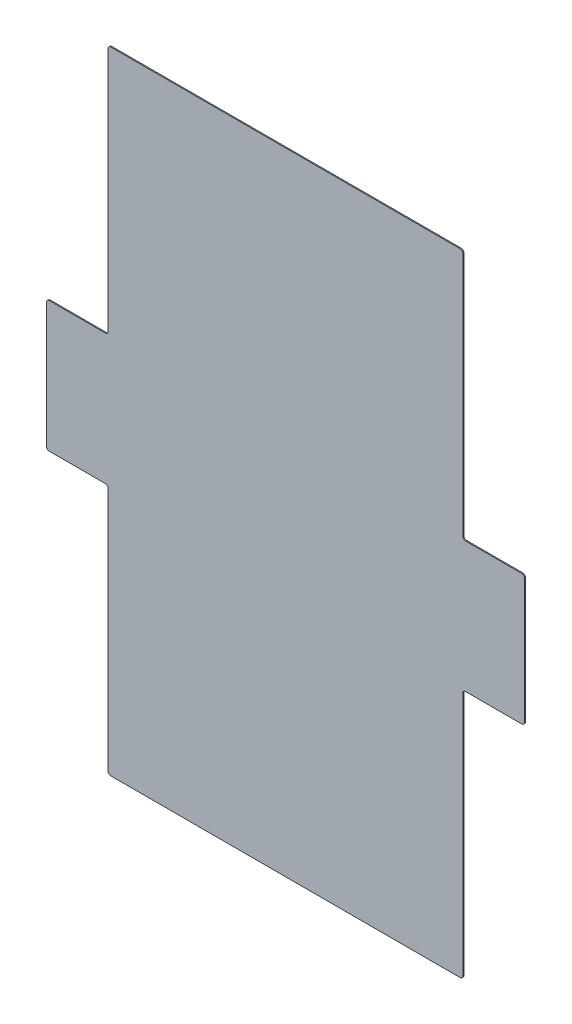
ISO-10303-21;
HEADER;
FILE_DESCRIPTION(('STEP AP214'),'2;1');
FILE_NAME('part.step','',(''),(''),'','','');
FILE_SCHEMA(('AUTOMOTIVE_DESIGN { 1 0 10303 214 1 1 1 1 }'));
ENDSEC;
DATA;
#1=APPLICATION_CONTEXT('core data for automotive mechanical design processes');
#2=APPLICATION_PROTOCOL_DEFINITION('international standard','automotive_design',2000,#1);
#3=PRODUCT_CONTEXT('',#1,'mechanical');
#4=PRODUCT('Part','Part','',(#3));
#5=PRODUCT_RELATED_PRODUCT_CATEGORY('part','',(#4));
#6=PRODUCT_DEFINITION_FORMATION('','',#4);
#7=PRODUCT_DEFINITION_CONTEXT('part definition',#1,'design');
#8=PRODUCT_DEFINITION('design','',#6,#7);
#9=PRODUCT_DEFINITION_SHAPE('','',#8);
#10=(LENGTH_UNIT() NAMED_UNIT(*) SI_UNIT(.MILLI.,.METRE.));
#11=(NAMED_UNIT(*) PLANE_ANGLE_UNIT() SI_UNIT($,.RADIAN.));
#12=(NAMED_UNIT(*) SI_UNIT($,.STERADIAN.) SOLID_ANGLE_UNIT());
#13=UNCERTAINTY_MEASURE_WITH_UNIT(LENGTH_MEASURE(1.E-05),#10,'distance_accuracy_value','');
#14=(GEOMETRIC_REPRESENTATION_CONTEXT(3) GLOBAL_UNCERTAINTY_ASSIGNED_CONTEXT((#13)) GLOBAL_UNIT_ASSIGNED_CONTEXT((#10,
#11,#12)) REPRESENTATION_CONTEXT('',''));
#15=CARTESIAN_POINT('',(0.,0.,0.));
#16=DIRECTION('',(0.,0.,1.));
#17=DIRECTION('',(1.,0.,0.));
#18=AXIS2_PLACEMENT_3D('',#15,#16,#17);
#19=CARTESIAN_POINT('',(-453.,120.,2.00000000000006));
#20=DIRECTION('',(0.,0.,-1.));
#21=DIRECTION('',(-1.,0.,0.));
#22=AXIS2_PLACEMENT_3D('',#19,#20,#21);
#23=CYLINDRICAL_SURFACE('',#22,5.);
#24=CARTESIAN_POINT('',(-453.,120.,0.));
#25=DIRECTION('',(0.,0.,-1.));
#26=DIRECTION('',(-1.,0.,0.));
#27=AXIS2_PLACEMENT_3D('',#24,#25,#26);
#28=CIRCLE('',#27,5.);
#29=CARTESIAN_POINT('',(-458.,120.,0.));
#30=VERTEX_POINT('',#29);
#31=CARTESIAN_POINT('',(-453.,125.,0.));
#32=VERTEX_POINT('',#31);
#33=EDGE_CURVE('E189',#30,#32,#28,.T.);
#34=ORIENTED_EDGE('',*,*,#33,.F.);
#35=DIRECTION('',(0.,0.,-1.));
#36=VECTOR('',#35,1.);
#37=CARTESIAN_POINT('',(-458.,120.,2.00000000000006));
#38=LINE('',#37,#36);
#39=CARTESIAN_POINT('',(-458.,120.,2.00000000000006));
#40=VERTEX_POINT('',#39);
#41=EDGE_CURVE('E11',#40,#30,#38,.T.);
#42=ORIENTED_EDGE('',*,*,#41,.F.);
#43=CARTESIAN_POINT('',(-453.,120.,2.00000000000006));
#44=DIRECTION('',(0.,0.,-1.));
#45=DIRECTION('',(-1.,0.,0.));
#46=AXIS2_PLACEMENT_3D('',#43,#44,#45);
#47=CIRCLE('',#46,5.);
#48=CARTESIAN_POINT('',(-453.,125.,2.00000000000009));
#49=VERTEX_POINT('',#48);
#50=EDGE_CURVE('E190',#40,#49,#47,.T.);
#51=ORIENTED_EDGE('',*,*,#50,.T.);
#52=DIRECTION('',(0.,0.,-1.));
#53=VECTOR('',#52,1.);
#54=CARTESIAN_POINT('',(-453.,125.,2.00000000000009));
#55=LINE('',#54,#53);
#56=EDGE_CURVE('E31',#49,#32,#55,.T.);
#57=ORIENTED_EDGE('',*,*,#56,.T.);
#58=EDGE_LOOP('',(#34,#42,#51,#57));
#59=FACE_BOUND('',#58,.T.);
#60=ADVANCED_FACE('F28',(#59),#23,.T.);
#61=CARTESIAN_POINT('',(-458.,120.,2.00000000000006));
#62=DIRECTION('',(1.,0.,0.));
#63=DIRECTION('',(0.,0.,-1.));
#64=AXIS2_PLACEMENT_3D('',#61,#62,#63);
#65=PLANE('',#64);
#66=DIRECTION('',(0.,-1.,0.));
#67=VECTOR('',#66,1.);
#68=CARTESIAN_POINT('',(-458.,120.,0.));
#69=LINE('',#68,#67);
#70=CARTESIAN_POINT('',(-458.,-120.,0.));
#71=VERTEX_POINT('',#70);
#72=EDGE_CURVE('E207',#30,#71,#69,.T.);
#73=ORIENTED_EDGE('',*,*,#72,.T.);
#74=DIRECTION('',(0.,0.,-1.));
#75=VECTOR('',#74,1.);
#76=CARTESIAN_POINT('',(-458.,-120.,2.00000000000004));
#77=LINE('',#76,#75);
#78=CARTESIAN_POINT('',(-458.,-120.,2.00000000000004));
#79=VERTEX_POINT('',#78);
#80=EDGE_CURVE('E36',#79,#71,#77,.T.);
#81=ORIENTED_EDGE('',*,*,#80,.F.);
#82=DIRECTION('',(0.,-1.,0.));
#83=VECTOR('',#82,1.);
#84=CARTESIAN_POINT('',(-458.,120.,2.00000000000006));
#85=LINE('',#84,#83);
#86=EDGE_CURVE('E49',#40,#79,#85,.T.);
#87=ORIENTED_EDGE('',*,*,#86,.F.);
#88=ORIENTED_EDGE('',*,*,#41,.T.);
#89=EDGE_LOOP('',(#73,#81,#87,#88));
#90=FACE_BOUND('',#89,.T.);
#91=ADVANCED_FACE('F461',(#90),#65,.F.);
#92=CARTESIAN_POINT('',(-453.,-120.,2.00000000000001));
#93=DIRECTION('',(0.,0.,-1.));
#94=DIRECTION('',(-1.,0.,0.));
#95=AXIS2_PLACEMENT_3D('',#92,#93,#94);
#96=CYLINDRICAL_SURFACE('',#95,5.);
#97=CARTESIAN_POINT('',(-453.,-120.,0.));
#98=DIRECTION('',(0.,0.,-1.));
#99=DIRECTION('',(-1.,0.,0.));
#100=AXIS2_PLACEMENT_3D('',#97,#98,#99);
#101=CIRCLE('',#100,5.);
#102=CARTESIAN_POINT('',(-453.,-125.,0.));
#103=VERTEX_POINT('',#102);
#104=EDGE_CURVE('E268',#103,#71,#101,.T.);
#105=ORIENTED_EDGE('',*,*,#104,.F.);
#106=DIRECTION('',(0.,0.,-1.));
#107=VECTOR('',#106,1.);
#108=CARTESIAN_POINT('',(-453.,-125.,2.00000000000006));
#109=LINE('',#108,#107);
#110=CARTESIAN_POINT('',(-453.,-125.,2.00000000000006));
#111=VERTEX_POINT('',#110);
#112=EDGE_CURVE('E334',#111,#103,#109,.T.);
#113=ORIENTED_EDGE('',*,*,#112,.F.);
#114=CARTESIAN_POINT('',(-453.,-120.,2.00000000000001));
#115=DIRECTION('',(0.,0.,-1.));
#116=DIRECTION('',(-1.,0.,0.));
#117=AXIS2_PLACEMENT_3D('',#114,#115,#116);
#118=CIRCLE('',#117,5.);
#119=EDGE_CURVE('E329',#111,#79,#118,.T.);
#120=ORIENTED_EDGE('',*,*,#119,.T.);
#121=ORIENTED_EDGE('',*,*,#80,.T.);
#122=EDGE_LOOP('',(#105,#113,#120,#121));
#123=FACE_BOUND('',#122,.T.);
#124=ADVANCED_FACE('F459',(#123),#96,.T.);
#125=CARTESIAN_POINT('',(-345.,-125.,2.00000000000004));
#126=DIRECTION('',(0.,-1.,0.));
#127=DIRECTION('',(1.,0.,0.));
#128=AXIS2_PLACEMENT_3D('',#125,#126,#127);
#129=PLANE('',#128);
#130=DIRECTION('',(-1.,0.,0.));
#131=VECTOR('',#130,1.);
#132=CARTESIAN_POINT('',(-345.,-125.,0.));
#133=LINE('',#132,#131);
#134=CARTESIAN_POINT('',(-345.,-125.,0.));
#135=VERTEX_POINT('',#134);
#136=EDGE_CURVE('E265',#135,#103,#133,.T.);
#137=ORIENTED_EDGE('',*,*,#136,.F.);
#138=DIRECTION('',(0.,0.,-1.));
#139=VECTOR('',#138,1.);
#140=CARTESIAN_POINT('',(-345.,-125.,2.00000000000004));
#141=LINE('',#140,#139);
#142=CARTESIAN_POINT('',(-345.,-125.,2.00000000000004));
#143=VERTEX_POINT('',#142);
#144=EDGE_CURVE('E336',#143,#135,#141,.T.);
#145=ORIENTED_EDGE('',*,*,#144,.F.);
#146=DIRECTION('',(-1.,0.,0.));
#147=VECTOR('',#146,1.);
#148=CARTESIAN_POINT('',(-345.,-125.,2.00000000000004));
#149=LINE('',#148,#147);
#150=EDGE_CURVE('E326',#143,#111,#149,.T.);
#151=ORIENTED_EDGE('',*,*,#150,.T.);
#152=ORIENTED_EDGE('',*,*,#112,.T.);
#153=EDGE_LOOP('',(#137,#145,#151,#152));
#154=FACE_BOUND('',#153,.T.);
#155=ADVANCED_FACE('F456',(#154),#129,.T.);
#156=CARTESIAN_POINT('',(-345.,-130.,2.00000000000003));
#157=DIRECTION('',(0.,0.,-1.));
#158=DIRECTION('',(-1.,0.,0.));
#159=AXIS2_PLACEMENT_3D('',#156,#157,#158);
#160=CYLINDRICAL_SURFACE('',#159,5.00000000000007);
#161=CARTESIAN_POINT('',(-345.,-130.,0.));
#162=DIRECTION('',(0.,0.,1.));
#163=DIRECTION('',(1.,0.,0.));
#164=AXIS2_PLACEMENT_3D('',#161,#162,#163);
#165=CIRCLE('',#164,5.00000000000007);
#166=CARTESIAN_POINT('',(-340.,-130.,0.));
#167=VERTEX_POINT('',#166);
#168=EDGE_CURVE('E262',#167,#135,#165,.T.);
#169=ORIENTED_EDGE('',*,*,#168,.F.);
#170=DIRECTION('',(0.,0.,-1.));
#171=VECTOR('',#170,1.);
#172=CARTESIAN_POINT('',(-340.,-130.,2.00000000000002));
#173=LINE('',#172,#171);
#174=CARTESIAN_POINT('',(-340.,-130.,2.00000000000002));
#175=VERTEX_POINT('',#174);
#176=EDGE_CURVE('E338',#175,#167,#173,.T.);
#177=ORIENTED_EDGE('',*,*,#176,.F.);
#178=CARTESIAN_POINT('',(-345.,-130.,2.00000000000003));
#179=DIRECTION('',(0.,0.,1.));
#180=DIRECTION('',(1.,0.,0.));
#181=AXIS2_PLACEMENT_3D('',#178,#179,#180);
#182=CIRCLE('',#181,5.00000000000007);
#183=EDGE_CURVE('E323',#175,#143,#182,.T.);
#184=ORIENTED_EDGE('',*,*,#183,.T.);
#185=ORIENTED_EDGE('',*,*,#144,.T.);
#186=EDGE_LOOP('',(#169,#177,#184,#185));
#187=FACE_BOUND('',#186,.T.);
#188=ADVANCED_FACE('F451',(#187),#160,.F.);
#189=CARTESIAN_POINT('',(-340.,-130.,2.00000000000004));
#190=DIRECTION('',(1.,0.,0.));
#191=DIRECTION('',(0.,0.,-1.));
#192=AXIS2_PLACEMENT_3D('',#189,#190,#191);
#193=PLANE('',#192);
#194=DIRECTION('',(0.,-1.,0.));
#195=VECTOR('',#194,1.);
#196=CARTESIAN_POINT('',(-340.,-130.,0.));
#197=LINE('',#196,#195);
#198=CARTESIAN_POINT('',(-340.,-600.,0.));
#199=VERTEX_POINT('',#198);
#200=EDGE_CURVE('E259',#167,#199,#197,.T.);
#201=ORIENTED_EDGE('',*,*,#200,.T.);
#202=DIRECTION('',(0.,0.,-1.));
#203=VECTOR('',#202,1.);
#204=CARTESIAN_POINT('',(-340.,-600.,1.99999999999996));
#205=LINE('',#204,#203);
#206=CARTESIAN_POINT('',(-340.,-600.,1.99999999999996));
#207=VERTEX_POINT('',#206);
#208=EDGE_CURVE('E340',#207,#199,#205,.T.);
#209=ORIENTED_EDGE('',*,*,#208,.F.);
#210=DIRECTION('',(0.,-1.,0.));
#211=VECTOR('',#210,1.);
#212=CARTESIAN_POINT('',(-340.,-130.,2.00000000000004));
#213=LINE('',#212,#211);
#214=EDGE_CURVE('E321',#175,#207,#213,.T.);
#215=ORIENTED_EDGE('',*,*,#214,.F.);
#216=ORIENTED_EDGE('',*,*,#176,.T.);
#217=EDGE_LOOP('',(#201,#209,#215,#216));
#218=FACE_BOUND('',#217,.T.);
#219=ADVANCED_FACE('F448',(#218),#193,.F.);
#220=CARTESIAN_POINT('',(-335.,-600.,1.99999999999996));
#221=DIRECTION('',(0.,0.,-1.));
#222=DIRECTION('',(-1.,0.,0.));
#223=AXIS2_PLACEMENT_3D('',#220,#221,#222);
#224=CYLINDRICAL_SURFACE('',#223,5.);
#225=CARTESIAN_POINT('',(-335.,-600.,0.));
#226=DIRECTION('',(0.,0.,-1.));
#227=DIRECTION('',(-1.,0.,0.));
#228=AXIS2_PLACEMENT_3D('',#225,#226,#227);
#229=CIRCLE('',#228,5.);
#230=CARTESIAN_POINT('',(-335.,-605.,0.));
#231=VERTEX_POINT('',#230);
#232=EDGE_CURVE('E256',#231,#199,#229,.T.);
#233=ORIENTED_EDGE('',*,*,#232,.F.);
#234=DIRECTION('',(0.,0.,-1.));
#235=VECTOR('',#234,1.);
#236=CARTESIAN_POINT('',(-335.,-605.,1.99999999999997));
#237=LINE('',#236,#235);
#238=CARTESIAN_POINT('',(-335.,-605.,1.99999999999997));
#239=VERTEX_POINT('',#238);
#240=EDGE_CURVE('E342',#239,#231,#237,.T.);
#241=ORIENTED_EDGE('',*,*,#240,.F.);
#242=CARTESIAN_POINT('',(-335.,-600.,1.99999999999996));
#243=DIRECTION('',(0.,0.,-1.));
#244=DIRECTION('',(-1.,0.,0.));
#245=AXIS2_PLACEMENT_3D('',#242,#243,#244);
#246=CIRCLE('',#245,5.);
#247=EDGE_CURVE('E318',#239,#207,#246,.T.);
#248=ORIENTED_EDGE('',*,*,#247,.T.);
#249=ORIENTED_EDGE('',*,*,#208,.T.);
#250=EDGE_LOOP('',(#233,#241,#248,#249));
#251=FACE_BOUND('',#250,.T.);
#252=ADVANCED_FACE('F444',(#251),#224,.T.);
#253=CARTESIAN_POINT('',(335.,-605.,2.));
#254=DIRECTION('',(0.,-1.,0.));
#255=DIRECTION('',(1.,0.,0.));
#256=AXIS2_PLACEMENT_3D('',#253,#254,#255);
#257=PLANE('',#256);
#258=DIRECTION('',(-1.,0.,0.));
#259=VECTOR('',#258,1.);
#260=CARTESIAN_POINT('',(335.,-605.,-1.11022302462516E-13));
#261=LINE('',#260,#259);
#262=CARTESIAN_POINT('',(335.,-605.,-1.11022302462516E-13));
#263=VERTEX_POINT('',#262);
#264=EDGE_CURVE('E253',#263,#231,#261,.T.);
#265=ORIENTED_EDGE('',*,*,#264,.F.);
#266=DIRECTION('',(0.,0.,-1.));
#267=VECTOR('',#266,1.);
#268=CARTESIAN_POINT('',(335.,-605.,2.));
#269=LINE('',#268,#267);
#270=CARTESIAN_POINT('',(335.,-605.,2.));
#271=VERTEX_POINT('',#270);
#272=EDGE_CURVE('E344',#271,#263,#269,.T.);
#273=ORIENTED_EDGE('',*,*,#272,.F.);
#274=DIRECTION('',(-1.,0.,0.));
#275=VECTOR('',#274,1.);
#276=CARTESIAN_POINT('',(335.,-605.,2.));
#277=LINE('',#276,#275);
#278=EDGE_CURVE('E315',#271,#239,#277,.T.);
#279=ORIENTED_EDGE('',*,*,#278,.T.);
#280=ORIENTED_EDGE('',*,*,#240,.T.);
#281=EDGE_LOOP('',(#265,#273,#279,#280));
#282=FACE_BOUND('',#281,.T.);
#283=ADVANCED_FACE('F440',(#282),#257,.T.);
#284=CARTESIAN_POINT('',(335.,-600.,1.99999999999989));
#285=DIRECTION('',(0.,0.,-1.));
#286=DIRECTION('',(-1.,0.,0.));
#287=AXIS2_PLACEMENT_3D('',#284,#285,#286);
#288=CYLINDRICAL_SURFACE('',#287,5.);
#289=CARTESIAN_POINT('',(335.,-600.,-1.66533453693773E-13));
#290=DIRECTION('',(0.,0.,-1.));
#291=DIRECTION('',(-1.,0.,0.));
#292=AXIS2_PLACEMENT_3D('',#289,#290,#291);
#293=CIRCLE('',#292,5.);
#294=CARTESIAN_POINT('',(340.,-600.,-1.66533453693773E-13));
#295=VERTEX_POINT('',#294);
#296=EDGE_CURVE('E250',#295,#263,#293,.T.);
#297=ORIENTED_EDGE('',*,*,#296,.F.);
#298=DIRECTION('',(0.,0.,-1.));
#299=VECTOR('',#298,1.);
#300=CARTESIAN_POINT('',(340.,-600.,1.99999999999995));
#301=LINE('',#300,#299);
#302=CARTESIAN_POINT('',(340.,-600.,1.99999999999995));
#303=VERTEX_POINT('',#302);
#304=EDGE_CURVE('E346',#303,#295,#301,.T.);
#305=ORIENTED_EDGE('',*,*,#304,.F.);
#306=CARTESIAN_POINT('',(335.,-600.,1.99999999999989));
#307=DIRECTION('',(0.,0.,-1.));
#308=DIRECTION('',(-1.,0.,0.));
#309=AXIS2_PLACEMENT_3D('',#306,#307,#308);
#310=CIRCLE('',#309,5.);
#311=EDGE_CURVE('E312',#303,#271,#310,.T.);
#312=ORIENTED_EDGE('',*,*,#311,.T.);
#313=ORIENTED_EDGE('',*,*,#272,.T.);
#314=EDGE_LOOP('',(#297,#305,#312,#313));
#315=FACE_BOUND('',#314,.T.);
#316=ADVANCED_FACE('F435',(#315),#288,.T.);
#317=CARTESIAN_POINT('',(340.,-600.,1.99999999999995));
#318=DIRECTION('',(-1.,0.,0.));
#319=DIRECTION('',(0.,-1.,0.));
#320=AXIS2_PLACEMENT_3D('',#317,#318,#319);
#321=PLANE('',#320);
#322=DIRECTION('',(0.,1.,0.));
#323=VECTOR('',#322,1.);
#324=CARTESIAN_POINT('',(340.,-600.,-1.66533453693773E-13));
#325=LINE('',#324,#323);
#326=CARTESIAN_POINT('',(340.,-130.,-1.38777878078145E-13));
#327=VERTEX_POINT('',#326);
#328=EDGE_CURVE('E247',#295,#327,#325,.T.);
#329=ORIENTED_EDGE('',*,*,#328,.T.);
#330=DIRECTION('',(0.,0.,-1.));
#331=VECTOR('',#330,1.);
#332=CARTESIAN_POINT('',(340.,-130.,1.99999999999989));
#333=LINE('',#332,#331);
#334=CARTESIAN_POINT('',(340.,-130.,1.99999999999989));
#335=VERTEX_POINT('',#334);
#336=EDGE_CURVE('E348',#335,#327,#333,.T.);
#337=ORIENTED_EDGE('',*,*,#336,.F.);
#338=DIRECTION('',(0.,1.,0.));
#339=VECTOR('',#338,1.);
#340=CARTESIAN_POINT('',(340.,-600.,1.99999999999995));
#341=LINE('',#340,#339);
#342=EDGE_CURVE('E310',#303,#335,#341,.T.);
#343=ORIENTED_EDGE('',*,*,#342,.F.);
#344=ORIENTED_EDGE('',*,*,#304,.T.);
#345=EDGE_LOOP('',(#329,#337,#343,#344));
#346=FACE_BOUND('',#345,.T.);
#347=ADVANCED_FACE('F432',(#346),#321,.F.);
#348=CARTESIAN_POINT('',(345.,-130.,1.99999999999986));
#349=DIRECTION('',(0.,0.,-1.));
#350=DIRECTION('',(-1.,0.,0.));
#351=AXIS2_PLACEMENT_3D('',#348,#349,#350);
#352=CYLINDRICAL_SURFACE('',#351,5.00000000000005);
#353=CARTESIAN_POINT('',(345.,-130.,-1.38777878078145E-13));
#354=DIRECTION('',(0.,0.,1.));
#355=DIRECTION('',(1.,0.,0.));
#356=AXIS2_PLACEMENT_3D('',#353,#354,#355);
#357=CIRCLE('',#356,5.00000000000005);
#358=CARTESIAN_POINT('',(345.,-125.,-1.11022302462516E-13));
#359=VERTEX_POINT('',#358);
#360=EDGE_CURVE('E244',#359,#327,#357,.T.);
#361=ORIENTED_EDGE('',*,*,#360,.F.);
#362=DIRECTION('',(0.,0.,-1.));
#363=VECTOR('',#362,1.);
#364=CARTESIAN_POINT('',(345.,-125.,1.99999999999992));
#365=LINE('',#364,#363);
#366=CARTESIAN_POINT('',(345.,-125.,1.99999999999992));
#367=VERTEX_POINT('',#366);
#368=EDGE_CURVE('E350',#367,#359,#365,.T.);
#369=ORIENTED_EDGE('',*,*,#368,.F.);
#370=CARTESIAN_POINT('',(345.,-130.,1.99999999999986));
#371=DIRECTION('',(0.,0.,1.));
#372=DIRECTION('',(1.,0.,0.));
#373=AXIS2_PLACEMENT_3D('',#370,#371,#372);
#374=CIRCLE('',#373,5.00000000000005);
#375=EDGE_CURVE('E307',#367,#335,#374,.T.);
#376=ORIENTED_EDGE('',*,*,#375,.T.);
#377=ORIENTED_EDGE('',*,*,#336,.T.);
#378=EDGE_LOOP('',(#361,#369,#376,#377));
#379=FACE_BOUND('',#378,.T.);
#380=ADVANCED_FACE('F427',(#379),#352,.F.);
#381=CARTESIAN_POINT('',(453.,-125.,1.99999999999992));
#382=DIRECTION('',(0.,-1.,0.));
#383=DIRECTION('',(1.,0.,0.));
#384=AXIS2_PLACEMENT_3D('',#381,#382,#383);
#385=PLANE('',#384);
#386=DIRECTION('',(-1.,0.,0.));
#387=VECTOR('',#386,1.);
#388=CARTESIAN_POINT('',(453.,-125.,0.));
#389=LINE('',#388,#387);
#390=CARTESIAN_POINT('',(453.,-125.,0.));
#391=VERTEX_POINT('',#390);
#392=EDGE_CURVE('E241',#391,#359,#389,.T.);
#393=ORIENTED_EDGE('',*,*,#392,.F.);
#394=DIRECTION('',(0.,0.,-1.));
#395=VECTOR('',#394,1.);
#396=CARTESIAN_POINT('',(453.,-125.,1.99999999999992));
#397=LINE('',#396,#395);
#398=CARTESIAN_POINT('',(453.,-125.,1.99999999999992));
#399=VERTEX_POINT('',#398);
#400=EDGE_CURVE('E352',#399,#391,#397,.T.);
#401=ORIENTED_EDGE('',*,*,#400,.F.);
#402=DIRECTION('',(-1.,0.,0.));
#403=VECTOR('',#402,1.);
#404=CARTESIAN_POINT('',(453.,-125.,1.99999999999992));
#405=LINE('',#404,#403);
#406=EDGE_CURVE('E304',#399,#367,#405,.T.);
#407=ORIENTED_EDGE('',*,*,#406,.T.);
#408=ORIENTED_EDGE('',*,*,#368,.T.);
#409=EDGE_LOOP('',(#393,#401,#407,#408));
#410=FACE_BOUND('',#409,.T.);
#411=ADVANCED_FACE('F422',(#410),#385,.T.);
#412=CARTESIAN_POINT('',(453.,-120.,1.99999999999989));
#413=DIRECTION('',(0.,0.,-1.));
#414=DIRECTION('',(-1.,0.,0.));
#415=AXIS2_PLACEMENT_3D('',#412,#413,#414);
#416=CYLINDRICAL_SURFACE('',#415,4.9999999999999);
#417=CARTESIAN_POINT('',(453.,-120.,-1.11022302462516E-13));
#418=DIRECTION('',(0.,0.,-1.));
#419=DIRECTION('',(-1.,0.,0.));
#420=AXIS2_PLACEMENT_3D('',#417,#418,#419);
#421=CIRCLE('',#420,4.9999999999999);
#422=CARTESIAN_POINT('',(458.,-120.,-1.11022302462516E-13));
#423=VERTEX_POINT('',#422);
#424=EDGE_CURVE('E238',#423,#391,#421,.T.);
#425=ORIENTED_EDGE('',*,*,#424,.F.);
#426=DIRECTION('',(0.,0.,-1.));
#427=VECTOR('',#426,1.);
#428=CARTESIAN_POINT('',(458.,-120.,1.99999999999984));
#429=LINE('',#428,#427);
#430=CARTESIAN_POINT('',(458.,-120.,1.99999999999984));
#431=VERTEX_POINT('',#430);
#432=EDGE_CURVE('E354',#431,#423,#429,.T.);
#433=ORIENTED_EDGE('',*,*,#432,.F.);
#434=CARTESIAN_POINT('',(453.,-120.,1.99999999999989));
#435=DIRECTION('',(0.,0.,-1.));
#436=DIRECTION('',(-1.,0.,0.));
#437=AXIS2_PLACEMENT_3D('',#434,#435,#436);
#438=CIRCLE('',#437,4.9999999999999);
#439=EDGE_CURVE('E301',#431,#399,#438,.T.);
#440=ORIENTED_EDGE('',*,*,#439,.T.);
#441=ORIENTED_EDGE('',*,*,#400,.T.);
#442=EDGE_LOOP('',(#425,#433,#440,#441));
#443=FACE_BOUND('',#442,.T.);
#444=ADVANCED_FACE('F417',(#443),#416,.T.);
#445=CARTESIAN_POINT('',(458.,-120.,1.99999999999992));
#446=DIRECTION('',(-1.,0.,0.));
#447=DIRECTION('',(0.,0.,1.));
#448=AXIS2_PLACEMENT_3D('',#445,#446,#447);
#449=PLANE('',#448);
#450=DIRECTION('',(0.,1.,0.));
#451=VECTOR('',#450,1.);
#452=CARTESIAN_POINT('',(458.,-120.,0.));
#453=LINE('',#452,#451);
#454=CARTESIAN_POINT('',(458.,120.,0.));
#455=VERTEX_POINT('',#454);
#456=EDGE_CURVE('E235',#423,#455,#453,.T.);
#457=ORIENTED_EDGE('',*,*,#456,.T.);
#458=DIRECTION('',(0.,0.,-1.));
#459=VECTOR('',#458,1.);
#460=CARTESIAN_POINT('',(458.,120.,1.99999999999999));
#461=LINE('',#460,#459);
#462=CARTESIAN_POINT('',(458.,120.,1.99999999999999));
#463=VERTEX_POINT('',#462);
#464=EDGE_CURVE('E356',#463,#455,#461,.T.);
#465=ORIENTED_EDGE('',*,*,#464,.F.);
#466=DIRECTION('',(0.,1.,0.));
#467=VECTOR('',#466,1.);
#468=CARTESIAN_POINT('',(458.,-120.,1.99999999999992));
#469=LINE('',#468,#467);
#470=EDGE_CURVE('E299',#431,#463,#469,.T.);
#471=ORIENTED_EDGE('',*,*,#470,.F.);
#472=ORIENTED_EDGE('',*,*,#432,.T.);
#473=EDGE_LOOP('',(#457,#465,#471,#472));
#474=FACE_BOUND('',#473,.T.);
#475=ADVANCED_FACE('F414',(#474),#449,.F.);
#476=CARTESIAN_POINT('',(453.,120.,2.));
#477=DIRECTION('',(0.,0.,-1.));
#478=DIRECTION('',(-1.,0.,0.));
#479=AXIS2_PLACEMENT_3D('',#476,#477,#478);
#480=CYLINDRICAL_SURFACE('',#479,4.9999999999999);
#481=CARTESIAN_POINT('',(453.,120.,0.));
#482=DIRECTION('',(0.,0.,-1.));
#483=DIRECTION('',(-1.,0.,0.));
#484=AXIS2_PLACEMENT_3D('',#481,#482,#483);
#485=CIRCLE('',#484,4.9999999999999);
#486=CARTESIAN_POINT('',(453.,125.,0.));
#487=VERTEX_POINT('',#486);
#488=EDGE_CURVE('E232',#487,#455,#485,.T.);
#489=ORIENTED_EDGE('',*,*,#488,.F.);
#490=DIRECTION('',(0.,0.,-1.));
#491=VECTOR('',#490,1.);
#492=CARTESIAN_POINT('',(453.,125.,1.9999999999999));
#493=LINE('',#492,#491);
#494=CARTESIAN_POINT('',(453.,125.,1.9999999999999));
#495=VERTEX_POINT('',#494);
#496=EDGE_CURVE('E358',#495,#487,#493,.T.);
#497=ORIENTED_EDGE('',*,*,#496,.F.);
#498=CARTESIAN_POINT('',(453.,120.,2.));
#499=DIRECTION('',(0.,0.,-1.));
#500=DIRECTION('',(-1.,0.,0.));
#501=AXIS2_PLACEMENT_3D('',#498,#499,#500);
#502=CIRCLE('',#501,4.9999999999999);
#503=EDGE_CURVE('E296',#495,#463,#502,.T.);
#504=ORIENTED_EDGE('',*,*,#503,.T.);
#505=ORIENTED_EDGE('',*,*,#464,.T.);
#506=EDGE_LOOP('',(#489,#497,#504,#505));
#507=FACE_BOUND('',#506,.T.);
#508=ADVANCED_FACE('F410',(#507),#480,.T.);
#509=CARTESIAN_POINT('',(345.,125.,1.99999999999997));
#510=DIRECTION('',(0.,1.,0.));
#511=DIRECTION('',(-1.,0.,0.));
#512=AXIS2_PLACEMENT_3D('',#509,#510,#511);
#513=PLANE('',#512);
#514=DIRECTION('',(1.,0.,0.));
#515=VECTOR('',#514,1.);
#516=CARTESIAN_POINT('',(345.,125.,0.));
#517=LINE('',#516,#515);
#518=CARTESIAN_POINT('',(345.,125.,0.));
#519=VERTEX_POINT('',#518);
#520=EDGE_CURVE('E229',#519,#487,#517,.T.);
#521=ORIENTED_EDGE('',*,*,#520,.F.);
#522=DIRECTION('',(0.,0.,-1.));
#523=VECTOR('',#522,1.);
#524=CARTESIAN_POINT('',(345.,125.,1.99999999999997));
#525=LINE('',#524,#523);
#526=CARTESIAN_POINT('',(345.,125.,1.99999999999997));
#527=VERTEX_POINT('',#526);
#528=EDGE_CURVE('E360',#527,#519,#525,.T.);
#529=ORIENTED_EDGE('',*,*,#528,.F.);
#530=DIRECTION('',(1.,0.,0.));
#531=VECTOR('',#530,1.);
#532=CARTESIAN_POINT('',(345.,125.,1.99999999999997));
#533=LINE('',#532,#531);
#534=EDGE_CURVE('E293',#527,#495,#533,.T.);
#535=ORIENTED_EDGE('',*,*,#534,.T.);
#536=ORIENTED_EDGE('',*,*,#496,.T.);
#537=EDGE_LOOP('',(#521,#529,#535,#536));
#538=FACE_BOUND('',#537,.T.);
#539=ADVANCED_FACE('F406',(#538),#513,.T.);
#540=CARTESIAN_POINT('',(345.,130.,2.));
#541=DIRECTION('',(0.,0.,-1.));
#542=DIRECTION('',(-1.,0.,0.));
#543=AXIS2_PLACEMENT_3D('',#540,#541,#542);
#544=CYLINDRICAL_SURFACE('',#543,5.00000000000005);
#545=CARTESIAN_POINT('',(345.,130.,0.));
#546=DIRECTION('',(0.,0.,1.));
#547=DIRECTION('',(1.,0.,0.));
#548=AXIS2_PLACEMENT_3D('',#545,#546,#547);
#549=CIRCLE('',#548,5.00000000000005);
#550=CARTESIAN_POINT('',(340.,130.,0.));
#551=VERTEX_POINT('',#550);
#552=EDGE_CURVE('E226',#551,#519,#549,.T.);
#553=ORIENTED_EDGE('',*,*,#552,.F.);
#554=DIRECTION('',(0.,0.,-1.));
#555=VECTOR('',#554,1.);
#556=CARTESIAN_POINT('',(340.,130.,1.99999999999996));
#557=LINE('',#556,#555);
#558=CARTESIAN_POINT('',(340.,130.,1.99999999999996));
#559=VERTEX_POINT('',#558);
#560=EDGE_CURVE('E362',#559,#551,#557,.T.);
#561=ORIENTED_EDGE('',*,*,#560,.F.);
#562=CARTESIAN_POINT('',(345.,130.,2.));
#563=DIRECTION('',(0.,0.,1.));
#564=DIRECTION('',(1.,0.,0.));
#565=AXIS2_PLACEMENT_3D('',#562,#563,#564);
#566=CIRCLE('',#565,5.00000000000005);
#567=EDGE_CURVE('E290',#559,#527,#566,.T.);
#568=ORIENTED_EDGE('',*,*,#567,.T.);
#569=ORIENTED_EDGE('',*,*,#528,.T.);
#570=EDGE_LOOP('',(#553,#561,#568,#569));
#571=FACE_BOUND('',#570,.T.);
#572=ADVANCED_FACE('F401',(#571),#544,.F.);
#573=CARTESIAN_POINT('',(340.,130.,1.99999999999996));
#574=DIRECTION('',(-1.,0.,0.));
#575=DIRECTION('',(0.,-1.,0.));
#576=AXIS2_PLACEMENT_3D('',#573,#574,#575);
#577=PLANE('',#576);
#578=DIRECTION('',(0.,1.,0.));
#579=VECTOR('',#578,1.);
#580=CARTESIAN_POINT('',(340.,130.,0.));
#581=LINE('',#580,#579);
#582=CARTESIAN_POINT('',(340.,600.,0.));
#583=VERTEX_POINT('',#582);
#584=EDGE_CURVE('E223',#551,#583,#581,.T.);
#585=ORIENTED_EDGE('',*,*,#584,.T.);
#586=DIRECTION('',(0.,0.,-1.));
#587=VECTOR('',#586,1.);
#588=CARTESIAN_POINT('',(340.,600.,2.00000000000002));
#589=LINE('',#588,#587);
#590=CARTESIAN_POINT('',(340.,600.,2.00000000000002));
#591=VERTEX_POINT('',#590);
#592=EDGE_CURVE('E364',#591,#583,#589,.T.);
#593=ORIENTED_EDGE('',*,*,#592,.F.);
#594=DIRECTION('',(0.,1.,0.));
#595=VECTOR('',#594,1.);
#596=CARTESIAN_POINT('',(340.,130.,1.99999999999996));
#597=LINE('',#596,#595);
#598=EDGE_CURVE('E288',#559,#591,#597,.T.);
#599=ORIENTED_EDGE('',*,*,#598,.F.);
#600=ORIENTED_EDGE('',*,*,#560,.T.);
#601=EDGE_LOOP('',(#585,#593,#599,#600));
#602=FACE_BOUND('',#601,.T.);
#603=ADVANCED_FACE('F398',(#602),#577,.F.);
#604=CARTESIAN_POINT('',(335.,600.000000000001,2.00000000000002));
#605=DIRECTION('',(0.,0.,-1.));
#606=DIRECTION('',(-1.,0.,0.));
#607=AXIS2_PLACEMENT_3D('',#604,#605,#606);
#608=CYLINDRICAL_SURFACE('',#607,5.00000000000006);
#609=CARTESIAN_POINT('',(335.,600.000000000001,0.));
#610=DIRECTION('',(0.,0.,-1.));
#611=DIRECTION('',(-1.,0.,0.));
#612=AXIS2_PLACEMENT_3D('',#609,#610,#611);
#613=CIRCLE('',#612,5.00000000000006);
#614=CARTESIAN_POINT('',(335.,605.000000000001,0.));
#615=VERTEX_POINT('',#614);
#616=EDGE_CURVE('E220',#615,#583,#613,.T.);
#617=ORIENTED_EDGE('',*,*,#616,.F.);
#618=DIRECTION('',(0.,0.,-1.));
#619=VECTOR('',#618,1.);
#620=CARTESIAN_POINT('',(335.,605.000000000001,2.00000000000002));
#621=LINE('',#620,#619);
#622=CARTESIAN_POINT('',(335.,605.000000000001,2.00000000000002));
#623=VERTEX_POINT('',#622);
#624=EDGE_CURVE('E366',#623,#615,#621,.T.);
#625=ORIENTED_EDGE('',*,*,#624,.F.);
#626=CARTESIAN_POINT('',(335.,600.000000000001,2.00000000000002));
#627=DIRECTION('',(0.,0.,-1.));
#628=DIRECTION('',(-1.,0.,0.));
#629=AXIS2_PLACEMENT_3D('',#626,#627,#628);
#630=CIRCLE('',#629,5.00000000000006);
#631=EDGE_CURVE('E285',#623,#591,#630,.T.);
#632=ORIENTED_EDGE('',*,*,#631,.T.);
#633=ORIENTED_EDGE('',*,*,#592,.T.);
#634=EDGE_LOOP('',(#617,#625,#632,#633));
#635=FACE_BOUND('',#634,.T.);
#636=ADVANCED_FACE('F393',(#635),#608,.T.);
#637=CARTESIAN_POINT('',(-335.,605.,2.00000000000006));
#638=DIRECTION('',(0.,1.,0.));
#639=DIRECTION('',(-1.,0.,0.));
#640=AXIS2_PLACEMENT_3D('',#637,#638,#639);
#641=PLANE('',#640);
#642=DIRECTION('',(1.,0.,0.));
#643=VECTOR('',#642,1.);
#644=CARTESIAN_POINT('',(-335.,605.,1.66533453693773E-13));
#645=LINE('',#644,#643);
#646=CARTESIAN_POINT('',(-335.,605.,1.66533453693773E-13));
#647=VERTEX_POINT('',#646);
#648=EDGE_CURVE('E217',#647,#615,#645,.T.);
#649=ORIENTED_EDGE('',*,*,#648,.F.);
#650=DIRECTION('',(0.,0.,-1.));
#651=VECTOR('',#650,1.);
#652=CARTESIAN_POINT('',(-335.,605.,2.00000000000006));
#653=LINE('',#652,#651);
#654=CARTESIAN_POINT('',(-335.,605.,2.00000000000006));
#655=VERTEX_POINT('',#654);
#656=EDGE_CURVE('E368',#655,#647,#653,.T.);
#657=ORIENTED_EDGE('',*,*,#656,.F.);
#658=DIRECTION('',(1.,0.,0.));
#659=VECTOR('',#658,1.);
#660=CARTESIAN_POINT('',(-335.,605.,2.00000000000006));
#661=LINE('',#660,#659);
#662=EDGE_CURVE('E282',#655,#623,#661,.T.);
#663=ORIENTED_EDGE('',*,*,#662,.T.);
#664=ORIENTED_EDGE('',*,*,#624,.T.);
#665=EDGE_LOOP('',(#649,#657,#663,#664));
#666=FACE_BOUND('',#665,.T.);
#667=ADVANCED_FACE('F388',(#666),#641,.T.);
#668=CARTESIAN_POINT('',(-335.,600.,2.00000000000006));
#669=DIRECTION('',(0.,0.,-1.));
#670=DIRECTION('',(-1.,0.,0.));
#671=AXIS2_PLACEMENT_3D('',#668,#669,#670);
#672=CYLINDRICAL_SURFACE('',#671,5.00000000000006);
#673=CARTESIAN_POINT('',(-335.,600.,1.66533453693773E-13));
#674=DIRECTION('',(0.,0.,-1.));
#675=DIRECTION('',(-1.,0.,0.));
#676=AXIS2_PLACEMENT_3D('',#673,#674,#675);
#677=CIRCLE('',#676,5.00000000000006);
#678=CARTESIAN_POINT('',(-340.,600.,2.22044604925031E-13));
#679=VERTEX_POINT('',#678);
#680=EDGE_CURVE('E214',#679,#647,#677,.T.);
#681=ORIENTED_EDGE('',*,*,#680,.F.);
#682=DIRECTION('',(0.,0.,-1.));
#683=VECTOR('',#682,1.);
#684=CARTESIAN_POINT('',(-340.,600.,2.00000000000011));
#685=LINE('',#684,#683);
#686=CARTESIAN_POINT('',(-340.,600.,2.00000000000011));
#687=VERTEX_POINT('',#686);
#688=EDGE_CURVE('E370',#687,#679,#685,.T.);
#689=ORIENTED_EDGE('',*,*,#688,.F.);
#690=CARTESIAN_POINT('',(-335.,600.,2.00000000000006));
#691=DIRECTION('',(0.,0.,-1.));
#692=DIRECTION('',(-1.,0.,0.));
#693=AXIS2_PLACEMENT_3D('',#690,#691,#692);
#694=CIRCLE('',#693,5.00000000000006);
#695=EDGE_CURVE('E279',#687,#655,#694,.T.);
#696=ORIENTED_EDGE('',*,*,#695,.T.);
#697=ORIENTED_EDGE('',*,*,#656,.T.);
#698=EDGE_LOOP('',(#681,#689,#696,#697));
#699=FACE_BOUND('',#698,.T.);
#700=ADVANCED_FACE('F383',(#699),#672,.T.);
#701=CARTESIAN_POINT('',(-340.,600.,2.00000000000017));
#702=DIRECTION('',(1.,0.,0.));
#703=DIRECTION('',(0.,1.,0.));
#704=AXIS2_PLACEMENT_3D('',#701,#702,#703);
#705=PLANE('',#704);
#706=DIRECTION('',(0.,-1.,0.));
#707=VECTOR('',#706,1.);
#708=CARTESIAN_POINT('',(-340.,600.,1.66533453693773E-13));
#709=LINE('',#708,#707);
#710=CARTESIAN_POINT('',(-340.,130.,1.2490009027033E-13));
#711=VERTEX_POINT('',#710);
#712=EDGE_CURVE('E211',#679,#711,#709,.T.);
#713=ORIENTED_EDGE('',*,*,#712,.T.);
#714=DIRECTION('',(0.,0.,-1.));
#715=VECTOR('',#714,1.);
#716=CARTESIAN_POINT('',(-340.,130.,2.0000000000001));
#717=LINE('',#716,#715);
#718=CARTESIAN_POINT('',(-340.,130.,2.0000000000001));
#719=VERTEX_POINT('',#718);
#720=EDGE_CURVE('E372',#719,#711,#717,.T.);
#721=ORIENTED_EDGE('',*,*,#720,.F.);
#722=DIRECTION('',(0.,-1.,0.));
#723=VECTOR('',#722,1.);
#724=CARTESIAN_POINT('',(-340.,600.,2.00000000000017));
#725=LINE('',#724,#723);
#726=EDGE_CURVE('E277',#687,#719,#725,.T.);
#727=ORIENTED_EDGE('',*,*,#726,.F.);
#728=ORIENTED_EDGE('',*,*,#688,.T.);
#729=EDGE_LOOP('',(#713,#721,#727,#728));
#730=FACE_BOUND('',#729,.T.);
#731=ADVANCED_FACE('F380',(#730),#705,.F.);
#732=CARTESIAN_POINT('',(-345.,130.,2.0000000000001));
#733=DIRECTION('',(0.,0.,-1.));
#734=DIRECTION('',(-1.,0.,0.));
#735=AXIS2_PLACEMENT_3D('',#732,#733,#734);
#736=CYLINDRICAL_SURFACE('',#735,5.00000000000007);
#737=CARTESIAN_POINT('',(-345.,130.,0.));
#738=DIRECTION('',(0.,0.,1.));
#739=DIRECTION('',(1.,0.,0.));
#740=AXIS2_PLACEMENT_3D('',#737,#738,#739);
#741=CIRCLE('',#740,5.00000000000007);
#742=CARTESIAN_POINT('',(-345.,125.,0.));
#743=VERTEX_POINT('',#742);
#744=EDGE_CURVE('E201',#743,#711,#741,.T.);
#745=ORIENTED_EDGE('',*,*,#744,.F.);
#746=DIRECTION('',(0.,0.,-1.));
#747=VECTOR('',#746,1.);
#748=CARTESIAN_POINT('',(-345.,125.,2.00000000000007));
#749=LINE('',#748,#747);
#750=CARTESIAN_POINT('',(-345.,125.,2.00000000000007));
#751=VERTEX_POINT('',#750);
#752=EDGE_CURVE('E194',#751,#743,#749,.T.);
#753=ORIENTED_EDGE('',*,*,#752,.F.);
#754=CARTESIAN_POINT('',(-345.,130.,2.0000000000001));
#755=DIRECTION('',(0.,0.,1.));
#756=DIRECTION('',(1.,0.,0.));
#757=AXIS2_PLACEMENT_3D('',#754,#755,#756);
#758=CIRCLE('',#757,5.00000000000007);
#759=EDGE_CURVE('E274',#751,#719,#758,.T.);
#760=ORIENTED_EDGE('',*,*,#759,.T.);
#761=ORIENTED_EDGE('',*,*,#720,.T.);
#762=EDGE_LOOP('',(#745,#753,#760,#761));
#763=FACE_BOUND('',#762,.T.);
#764=ADVANCED_FACE('F375',(#763),#736,.F.);
#765=CARTESIAN_POINT('',(-453.,125.,2.00000000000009));
#766=DIRECTION('',(0.,1.,0.));
#767=DIRECTION('',(-1.,0.,0.));
#768=AXIS2_PLACEMENT_3D('',#765,#766,#767);
#769=PLANE('',#768);
#770=DIRECTION('',(1.,0.,0.));
#771=VECTOR('',#770,1.);
#772=CARTESIAN_POINT('',(-453.,125.,0.));
#773=LINE('',#772,#771);
#774=EDGE_CURVE('E196',#32,#743,#773,.T.);
#775=ORIENTED_EDGE('',*,*,#774,.F.);
#776=ORIENTED_EDGE('',*,*,#56,.F.);
#777=DIRECTION('',(1.,0.,0.));
#778=VECTOR('',#777,1.);
#779=CARTESIAN_POINT('',(-453.,125.,2.00000000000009));
#780=LINE('',#779,#778);
#781=EDGE_CURVE('E272',#49,#751,#780,.T.);
#782=ORIENTED_EDGE('',*,*,#781,.T.);
#783=ORIENTED_EDGE('',*,*,#752,.T.);
#784=EDGE_LOOP('',(#775,#776,#782,#783));
#785=FACE_BOUND('',#784,.T.);
#786=ADVANCED_FACE('F197',(#785),#769,.T.);
#787=CARTESIAN_POINT('',(-453.,120.,2.00000000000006));
#788=DIRECTION('',(0.,0.,-1.));
#789=DIRECTION('',(-1.,0.,0.));
#790=AXIS2_PLACEMENT_3D('',#787,#788,#789);
#791=PLANE('',#790);
#792=ORIENTED_EDGE('',*,*,#50,.F.);
#793=ORIENTED_EDGE('',*,*,#86,.T.);
#794=ORIENTED_EDGE('',*,*,#119,.F.);
#795=ORIENTED_EDGE('',*,*,#150,.F.);
#796=ORIENTED_EDGE('',*,*,#183,.F.);
#797=ORIENTED_EDGE('',*,*,#214,.T.);
#798=ORIENTED_EDGE('',*,*,#247,.F.);
#799=ORIENTED_EDGE('',*,*,#278,.F.);
#800=ORIENTED_EDGE('',*,*,#311,.F.);
#801=ORIENTED_EDGE('',*,*,#342,.T.);
#802=ORIENTED_EDGE('',*,*,#375,.F.);
#803=ORIENTED_EDGE('',*,*,#406,.F.);
#804=ORIENTED_EDGE('',*,*,#439,.F.);
#805=ORIENTED_EDGE('',*,*,#470,.T.);
#806=ORIENTED_EDGE('',*,*,#503,.F.);
#807=ORIENTED_EDGE('',*,*,#534,.F.);
#808=ORIENTED_EDGE('',*,*,#567,.F.);
#809=ORIENTED_EDGE('',*,*,#598,.T.);
#810=ORIENTED_EDGE('',*,*,#631,.F.);
#811=ORIENTED_EDGE('',*,*,#662,.F.);
#812=ORIENTED_EDGE('',*,*,#695,.F.);
#813=ORIENTED_EDGE('',*,*,#726,.T.);
#814=ORIENTED_EDGE('',*,*,#759,.F.);
#815=ORIENTED_EDGE('',*,*,#781,.F.);
#816=EDGE_LOOP('',(#792,#793,#794,#795,#796,#797,#798,#799,#800,#801,#802,#803,#804,#805,#806,
#807,#808,#809,#810,#811,#812,#813,#814,#815));
#817=FACE_BOUND('',#816,.T.);
#818=ADVANCED_FACE('F462',(#817),#791,.F.);
#819=CARTESIAN_POINT('',(-453.,120.,0.));
#820=DIRECTION('',(0.,0.,-1.));
#821=DIRECTION('',(-1.,0.,0.));
#822=AXIS2_PLACEMENT_3D('',#819,#820,#821);
#823=PLANE('',#822);
#824=ORIENTED_EDGE('',*,*,#33,.T.);
#825=ORIENTED_EDGE('',*,*,#774,.T.);
#826=ORIENTED_EDGE('',*,*,#744,.T.);
#827=ORIENTED_EDGE('',*,*,#712,.F.);
#828=ORIENTED_EDGE('',*,*,#680,.T.);
#829=ORIENTED_EDGE('',*,*,#648,.T.);
#830=ORIENTED_EDGE('',*,*,#616,.T.);
#831=ORIENTED_EDGE('',*,*,#584,.F.);
#832=ORIENTED_EDGE('',*,*,#552,.T.);
#833=ORIENTED_EDGE('',*,*,#520,.T.);
#834=ORIENTED_EDGE('',*,*,#488,.T.);
#835=ORIENTED_EDGE('',*,*,#456,.F.);
#836=ORIENTED_EDGE('',*,*,#424,.T.);
#837=ORIENTED_EDGE('',*,*,#392,.T.);
#838=ORIENTED_EDGE('',*,*,#360,.T.);
#839=ORIENTED_EDGE('',*,*,#328,.F.);
#840=ORIENTED_EDGE('',*,*,#296,.T.);
#841=ORIENTED_EDGE('',*,*,#264,.T.);
#842=ORIENTED_EDGE('',*,*,#232,.T.);
#843=ORIENTED_EDGE('',*,*,#200,.F.);
#844=ORIENTED_EDGE('',*,*,#168,.T.);
#845=ORIENTED_EDGE('',*,*,#136,.T.);
#846=ORIENTED_EDGE('',*,*,#104,.T.);
#847=ORIENTED_EDGE('',*,*,#72,.F.);
#848=EDGE_LOOP('',(#824,#825,#826,#827,#828,#829,#830,#831,#832,#833,#834,#835,#836,#837,#838,
#839,#840,#841,#842,#843,#844,#845,#846,#847));
#849=FACE_BOUND('',#848,.T.);
#850=ADVANCED_FACE('F204',(#849),#823,.T.);
#851=CLOSED_SHELL('',(#60,#91,#124,#155,#188,#219,#252,#283,#316,#347,#380,#411,#444,#475,#508,
#539,#572,#603,#636,#667,#700,#731,#764,#786,#818,#850));
#852=MANIFOLD_SOLID_BREP('B2',#851);
#853=ADVANCED_BREP_SHAPE_REPRESENTATION('',(#18,#852),#14);
#854=SHAPE_DEFINITION_REPRESENTATION(#9,#853);
ENDSEC;
END-ISO-10303-21;
